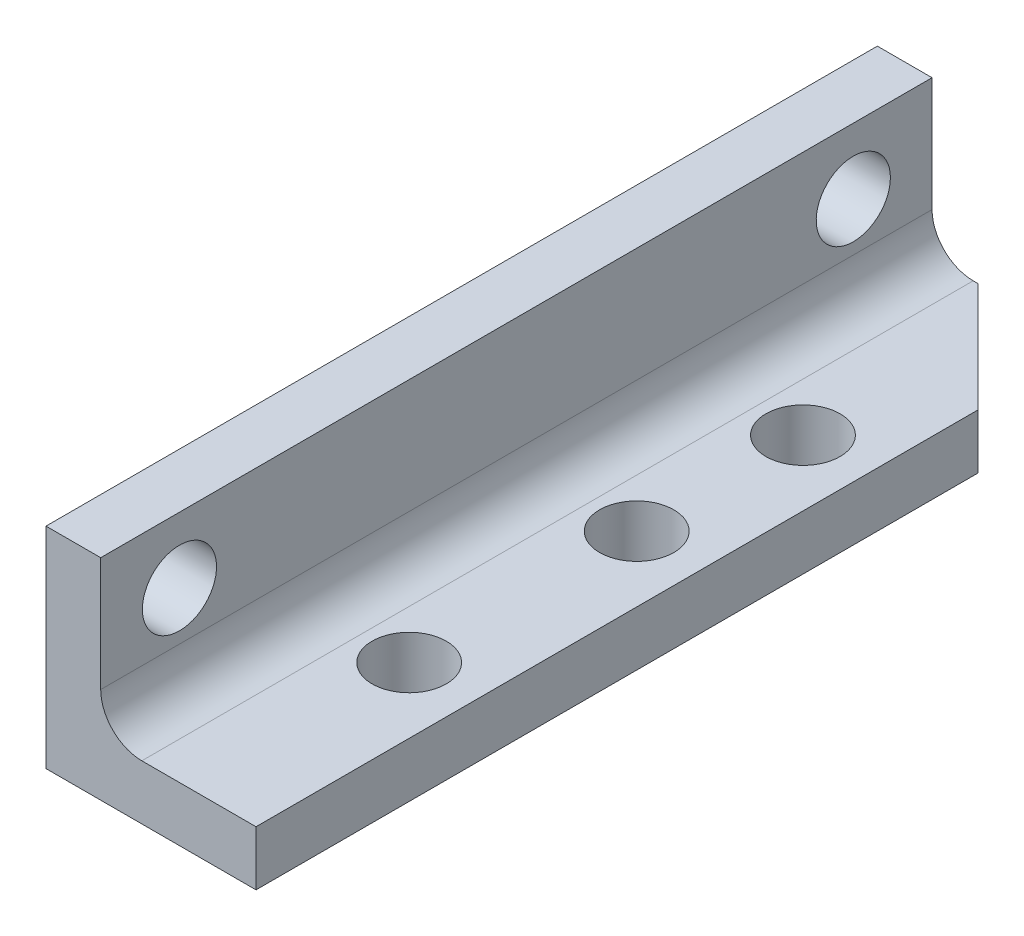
ISO-10303-21;
HEADER;
FILE_DESCRIPTION(('STEP AP214'),'2;1');
FILE_NAME('part.step','',(''),(''),'','','');
FILE_SCHEMA(('AUTOMOTIVE_DESIGN { 1 0 10303 214 1 1 1 1 }'));
ENDSEC;
DATA;
#1=APPLICATION_CONTEXT('core data for automotive mechanical design processes');
#2=APPLICATION_PROTOCOL_DEFINITION('international standard','automotive_design',2000,#1);
#3=PRODUCT_CONTEXT('',#1,'mechanical');
#4=PRODUCT('Part','Part','',(#3));
#5=PRODUCT_RELATED_PRODUCT_CATEGORY('part','',(#4));
#6=PRODUCT_DEFINITION_FORMATION('','',#4);
#7=PRODUCT_DEFINITION_CONTEXT('part definition',#1,'design');
#8=PRODUCT_DEFINITION('design','',#6,#7);
#9=PRODUCT_DEFINITION_SHAPE('','',#8);
#10=(LENGTH_UNIT() NAMED_UNIT(*) SI_UNIT(.MILLI.,.METRE.));
#11=(NAMED_UNIT(*) PLANE_ANGLE_UNIT() SI_UNIT($,.RADIAN.));
#12=(NAMED_UNIT(*) SI_UNIT($,.STERADIAN.) SOLID_ANGLE_UNIT());
#13=UNCERTAINTY_MEASURE_WITH_UNIT(LENGTH_MEASURE(1.E-05),#10,'distance_accuracy_value','');
#14=(GEOMETRIC_REPRESENTATION_CONTEXT(3) GLOBAL_UNCERTAINTY_ASSIGNED_CONTEXT((#13)) GLOBAL_UNIT_ASSIGNED_CONTEXT((#10,
#11,#12)) REPRESENTATION_CONTEXT('',''));
#15=CARTESIAN_POINT('',(0.,0.,0.));
#16=DIRECTION('',(0.,0.,1.));
#17=DIRECTION('',(1.,0.,0.));
#18=AXIS2_PLACEMENT_3D('',#15,#16,#17);
#19=CARTESIAN_POINT('',(0.,0.,24.13));
#20=DIRECTION('',(1.,0.,0.));
#21=DIRECTION('',(0.,0.,-1.));
#22=AXIS2_PLACEMENT_3D('',#19,#20,#21);
#23=PLANE('',#22);
#24=CARTESIAN_POINT('',(0.,8.382,19.558));
#25=DIRECTION('',(-1.,0.,0.));
#26=DIRECTION('',(0.,0.,1.));
#27=AXIS2_PLACEMENT_3D('',#24,#25,#26);
#28=CIRCLE('',#27,2.15264999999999);
#29=CARTESIAN_POINT('',(0.,8.382,21.71065));
#30=VERTEX_POINT('',#29);
#31=EDGE_CURVE('E151',#30,#30,#28,.T.);
#32=ORIENTED_EDGE('',*,*,#31,.F.);
#33=EDGE_LOOP('',(#32));
#34=FACE_BOUND('',#33,.T.);
#35=DIRECTION('',(0.,0.,-1.));
#36=VECTOR('',#35,1.);
#37=CARTESIAN_POINT('',(0.,12.192,24.13));
#38=LINE('',#37,#36);
#39=CARTESIAN_POINT('',(0.,12.192,24.13));
#40=VERTEX_POINT('',#39);
#41=CARTESIAN_POINT('',(0.,12.192,-24.13));
#42=VERTEX_POINT('',#41);
#43=EDGE_CURVE('E124',#40,#42,#38,.T.);
#44=ORIENTED_EDGE('',*,*,#43,.T.);
#45=DIRECTION('',(0.,-1.,0.));
#46=VECTOR('',#45,1.);
#47=CARTESIAN_POINT('',(0.,0.,-24.13));
#48=LINE('',#47,#46);
#49=CARTESIAN_POINT('',(0.,0.,-24.13));
#50=VERTEX_POINT('',#49);
#51=EDGE_CURVE('E119',#42,#50,#48,.T.);
#52=ORIENTED_EDGE('',*,*,#51,.T.);
#53=DIRECTION('',(0.,0.,-1.));
#54=VECTOR('',#53,1.);
#55=CARTESIAN_POINT('',(0.,0.,24.13));
#56=LINE('',#55,#54);
#57=CARTESIAN_POINT('',(0.,0.,24.13));
#58=VERTEX_POINT('',#57);
#59=EDGE_CURVE('E102',#58,#50,#56,.T.);
#60=ORIENTED_EDGE('',*,*,#59,.F.);
#61=DIRECTION('',(0.,-1.,0.));
#62=VECTOR('',#61,1.);
#63=CARTESIAN_POINT('',(0.,0.,24.13));
#64=LINE('',#63,#62);
#65=EDGE_CURVE('E155',#40,#58,#64,.T.);
#66=ORIENTED_EDGE('',*,*,#65,.F.);
#67=EDGE_LOOP('',(#44,#52,#60,#66));
#68=FACE_BOUND('',#67,.T.);
#69=CARTESIAN_POINT('',(0.,8.382,-19.558));
#70=DIRECTION('',(1.,0.,0.));
#71=DIRECTION('',(0.,0.,-1.));
#72=AXIS2_PLACEMENT_3D('',#69,#70,#71);
#73=CIRCLE('',#72,2.15264999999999);
#74=CARTESIAN_POINT('',(0.,8.382,-21.71065));
#75=VERTEX_POINT('',#74);
#76=EDGE_CURVE('E129',#75,#75,#73,.T.);
#77=ORIENTED_EDGE('',*,*,#76,.T.);
#78=EDGE_LOOP('',(#77));
#79=FACE_BOUND('',#78,.T.);
#80=ADVANCED_FACE('F39',(#34,#68,#79),#23,.F.);
#81=CARTESIAN_POINT('',(0.,0.,24.13));
#82=DIRECTION('',(0.,1.,0.));
#83=DIRECTION('',(0.,0.,1.));
#84=AXIS2_PLACEMENT_3D('',#81,#82,#83);
#85=PLANE('',#84);
#86=CARTESIAN_POINT('',(8.382,0.,-1.778));
#87=DIRECTION('',(0.,1.,0.));
#88=DIRECTION('',(0.,0.,1.));
#89=AXIS2_PLACEMENT_3D('',#86,#87,#88);
#90=CIRCLE('',#89,2.15265);
#91=CARTESIAN_POINT('',(8.382,0.,0.374649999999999));
#92=VERTEX_POINT('',#91);
#93=EDGE_CURVE('E381',#92,#92,#90,.T.);
#94=ORIENTED_EDGE('',*,*,#93,.T.);
#95=EDGE_LOOP('',(#94));
#96=FACE_BOUND('',#95,.T.);
#97=CARTESIAN_POINT('',(8.382,0.,11.43));
#98=DIRECTION('',(0.,-1.,0.));
#99=DIRECTION('',(0.,0.,-1.));
#100=AXIS2_PLACEMENT_3D('',#97,#98,#99);
#101=CIRCLE('',#100,2.15264999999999);
#102=CARTESIAN_POINT('',(8.382,0.,9.27735000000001));
#103=VERTEX_POINT('',#102);
#104=EDGE_CURVE('E142',#103,#103,#101,.T.);
#105=ORIENTED_EDGE('',*,*,#104,.F.);
#106=EDGE_LOOP('',(#105));
#107=FACE_BOUND('',#106,.T.);
#108=DIRECTION('',(1.,0.,0.));
#109=VECTOR('',#108,1.);
#110=CARTESIAN_POINT('',(0.,0.,-24.13));
#111=LINE('',#110,#109);
#112=CARTESIAN_POINT('',(5.84199999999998,0.,-24.13));
#113=VERTEX_POINT('',#112);
#114=EDGE_CURVE('E105',#50,#113,#111,.T.);
#115=ORIENTED_EDGE('',*,*,#114,.T.);
#116=DIRECTION('',(0.707106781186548,0.,0.707106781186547));
#117=VECTOR('',#116,1.);
#118=CARTESIAN_POINT('',(12.192,0.,-17.78));
#119=LINE('',#118,#117);
#120=CARTESIAN_POINT('',(12.192,0.,-17.78));
#121=VERTEX_POINT('',#120);
#122=EDGE_CURVE('E11',#113,#121,#119,.T.);
#123=ORIENTED_EDGE('',*,*,#122,.T.);
#124=DIRECTION('',(0.,0.,-1.));
#125=VECTOR('',#124,1.);
#126=CARTESIAN_POINT('',(12.192,0.,24.13));
#127=LINE('',#126,#125);
#128=CARTESIAN_POINT('',(12.192,0.,24.13));
#129=VERTEX_POINT('',#128);
#130=EDGE_CURVE('E114',#129,#121,#127,.T.);
#131=ORIENTED_EDGE('',*,*,#130,.F.);
#132=DIRECTION('',(1.,0.,0.));
#133=VECTOR('',#132,1.);
#134=CARTESIAN_POINT('',(0.,0.,24.13));
#135=LINE('',#134,#133);
#136=EDGE_CURVE('E108',#58,#129,#135,.T.);
#137=ORIENTED_EDGE('',*,*,#136,.F.);
#138=ORIENTED_EDGE('',*,*,#59,.T.);
#139=EDGE_LOOP('',(#115,#123,#131,#137,#138));
#140=FACE_BOUND('',#139,.T.);
#141=CARTESIAN_POINT('',(8.382,0.,-11.43));
#142=DIRECTION('',(0.,1.,0.));
#143=DIRECTION('',(0.,0.,1.));
#144=AXIS2_PLACEMENT_3D('',#141,#142,#143);
#145=CIRCLE('',#144,2.15264999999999);
#146=CARTESIAN_POINT('',(8.382,0.,-9.27735000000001));
#147=VERTEX_POINT('',#146);
#148=EDGE_CURVE('E147',#147,#147,#145,.T.);
#149=ORIENTED_EDGE('',*,*,#148,.T.);
#150=EDGE_LOOP('',(#149));
#151=FACE_BOUND('',#150,.T.);
#152=ADVANCED_FACE('F103',(#96,#107,#140,#151),#85,.F.);
#153=CARTESIAN_POINT('',(12.192,0.,24.13));
#154=DIRECTION('',(-1.,0.,0.));
#155=DIRECTION('',(0.,-1.,0.));
#156=AXIS2_PLACEMENT_3D('',#153,#154,#155);
#157=PLANE('',#156);
#158=ORIENTED_EDGE('',*,*,#130,.T.);
#159=DIRECTION('',(0.,1.,0.));
#160=VECTOR('',#159,1.);
#161=CARTESIAN_POINT('',(12.192,3.175,-17.78));
#162=LINE('',#161,#160);
#163=CARTESIAN_POINT('',(12.192,3.175,-17.78));
#164=VERTEX_POINT('',#163);
#165=EDGE_CURVE('E113',#121,#164,#162,.T.);
#166=ORIENTED_EDGE('',*,*,#165,.T.);
#167=DIRECTION('',(0.,0.,-1.));
#168=VECTOR('',#167,1.);
#169=CARTESIAN_POINT('',(12.192,3.175,24.13));
#170=LINE('',#169,#168);
#171=CARTESIAN_POINT('',(12.192,3.175,24.13));
#172=VERTEX_POINT('',#171);
#173=EDGE_CURVE('E176',#172,#164,#170,.T.);
#174=ORIENTED_EDGE('',*,*,#173,.F.);
#175=DIRECTION('',(0.,1.,0.));
#176=VECTOR('',#175,1.);
#177=CARTESIAN_POINT('',(12.192,0.,24.13));
#178=LINE('',#177,#176);
#179=EDGE_CURVE('E158',#129,#172,#178,.T.);
#180=ORIENTED_EDGE('',*,*,#179,.F.);
#181=EDGE_LOOP('',(#158,#166,#174,#180));
#182=FACE_BOUND('',#181,.T.);
#183=ADVANCED_FACE('F189',(#182),#157,.F.);
#184=CARTESIAN_POINT('',(5.5626,3.175,24.13));
#185=DIRECTION('',(0.,-1.,0.));
#186=DIRECTION('',(0.,0.,-1.));
#187=AXIS2_PLACEMENT_3D('',#184,#185,#186);
#188=PLANE('',#187);
#189=CARTESIAN_POINT('',(8.382,3.175,-1.778));
#190=DIRECTION('',(0.,1.,0.));
#191=DIRECTION('',(0.,0.,1.));
#192=AXIS2_PLACEMENT_3D('',#189,#190,#191);
#193=CIRCLE('',#192,2.15264999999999);
#194=CARTESIAN_POINT('',(8.382,3.175,0.374649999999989));
#195=VERTEX_POINT('',#194);
#196=EDGE_CURVE('E379',#195,#195,#193,.T.);
#197=ORIENTED_EDGE('',*,*,#196,.F.);
#198=EDGE_LOOP('',(#197));
#199=FACE_BOUND('',#198,.T.);
#200=CARTESIAN_POINT('',(8.382,3.175,11.43));
#201=DIRECTION('',(0.,-1.,0.));
#202=DIRECTION('',(0.,0.,-1.));
#203=AXIS2_PLACEMENT_3D('',#200,#201,#202);
#204=CIRCLE('',#203,2.15264999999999);
#205=CARTESIAN_POINT('',(8.382,3.175,9.27735000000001));
#206=VERTEX_POINT('',#205);
#207=EDGE_CURVE('E150',#206,#206,#204,.T.);
#208=ORIENTED_EDGE('',*,*,#207,.T.);
#209=EDGE_LOOP('',(#208));
#210=FACE_BOUND('',#209,.T.);
#211=ORIENTED_EDGE('',*,*,#173,.T.);
#212=DIRECTION('',(-0.707106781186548,0.,-0.707106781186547));
#213=VECTOR('',#212,1.);
#214=CARTESIAN_POINT('',(12.192,3.175,-17.78));
#215=LINE('',#214,#213);
#216=CARTESIAN_POINT('',(5.84199999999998,3.175,-24.13));
#217=VERTEX_POINT('',#216);
#218=EDGE_CURVE('E61',#164,#217,#215,.T.);
#219=ORIENTED_EDGE('',*,*,#218,.T.);
#220=DIRECTION('',(-1.,0.,0.));
#221=VECTOR('',#220,1.);
#222=CARTESIAN_POINT('',(5.5626,3.175,-24.13));
#223=LINE('',#222,#221);
#224=CARTESIAN_POINT('',(5.5626,3.175,-24.13));
#225=VERTEX_POINT('',#224);
#226=EDGE_CURVE('E120',#217,#225,#223,.T.);
#227=ORIENTED_EDGE('',*,*,#226,.T.);
#228=DIRECTION('',(0.,0.,-1.));
#229=VECTOR('',#228,1.);
#230=CARTESIAN_POINT('',(5.5626,3.175,24.13));
#231=LINE('',#230,#229);
#232=CARTESIAN_POINT('',(5.5626,3.175,24.13));
#233=VERTEX_POINT('',#232);
#234=EDGE_CURVE('E173',#233,#225,#231,.T.);
#235=ORIENTED_EDGE('',*,*,#234,.F.);
#236=DIRECTION('',(-1.,0.,0.));
#237=VECTOR('',#236,1.);
#238=CARTESIAN_POINT('',(5.5626,3.175,24.13));
#239=LINE('',#238,#237);
#240=EDGE_CURVE('E160',#172,#233,#239,.T.);
#241=ORIENTED_EDGE('',*,*,#240,.F.);
#242=EDGE_LOOP('',(#211,#219,#227,#235,#241));
#243=FACE_BOUND('',#242,.T.);
#244=CARTESIAN_POINT('',(8.382,3.175,-11.43));
#245=DIRECTION('',(0.,1.,0.));
#246=DIRECTION('',(0.,0.,1.));
#247=AXIS2_PLACEMENT_3D('',#244,#245,#246);
#248=CIRCLE('',#247,2.15264999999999);
#249=CARTESIAN_POINT('',(8.382,3.175,-9.27735000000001));
#250=VERTEX_POINT('',#249);
#251=EDGE_CURVE('E144',#250,#250,#248,.T.);
#252=ORIENTED_EDGE('',*,*,#251,.F.);
#253=EDGE_LOOP('',(#252));
#254=FACE_BOUND('',#253,.T.);
#255=ADVANCED_FACE('F193',(#199,#210,#243,#254),#188,.F.);
#256=CARTESIAN_POINT('',(5.5626,5.5626,24.13));
#257=DIRECTION('',(0.,0.,-1.));
#258=DIRECTION('',(-1.,0.,0.));
#259=AXIS2_PLACEMENT_3D('',#256,#257,#258);
#260=CYLINDRICAL_SURFACE('',#259,2.3876);
#261=ORIENTED_EDGE('',*,*,#234,.T.);
#262=CARTESIAN_POINT('',(5.5626,5.5626,-24.13));
#263=DIRECTION('',(0.,0.,-1.));
#264=DIRECTION('',(1.,0.,0.));
#265=AXIS2_PLACEMENT_3D('',#262,#263,#264);
#266=CIRCLE('',#265,2.3876);
#267=CARTESIAN_POINT('',(3.175,5.5626,-24.13));
#268=VERTEX_POINT('',#267);
#269=EDGE_CURVE('E135',#225,#268,#266,.T.);
#270=ORIENTED_EDGE('',*,*,#269,.T.);
#271=DIRECTION('',(0.,0.,-1.));
#272=VECTOR('',#271,1.);
#273=CARTESIAN_POINT('',(3.175,5.5626,24.13));
#274=LINE('',#273,#272);
#275=CARTESIAN_POINT('',(3.175,5.5626,24.13));
#276=VERTEX_POINT('',#275);
#277=EDGE_CURVE('E171',#276,#268,#274,.T.);
#278=ORIENTED_EDGE('',*,*,#277,.F.);
#279=CARTESIAN_POINT('',(5.5626,5.5626,24.13));
#280=DIRECTION('',(0.,0.,-1.));
#281=DIRECTION('',(1.,0.,0.));
#282=AXIS2_PLACEMENT_3D('',#279,#280,#281);
#283=CIRCLE('',#282,2.3876);
#284=EDGE_CURVE('E162',#233,#276,#283,.T.);
#285=ORIENTED_EDGE('',*,*,#284,.F.);
#286=EDGE_LOOP('',(#261,#270,#278,#285));
#287=FACE_BOUND('',#286,.T.);
#288=ADVANCED_FACE('F225',(#287),#260,.F.);
#289=CARTESIAN_POINT('',(3.175,12.192,24.13));
#290=DIRECTION('',(-1.,0.,0.));
#291=DIRECTION('',(0.,-1.,0.));
#292=AXIS2_PLACEMENT_3D('',#289,#290,#291);
#293=PLANE('',#292);
#294=CARTESIAN_POINT('',(3.175,8.382,19.558));
#295=DIRECTION('',(-1.,0.,0.));
#296=DIRECTION('',(0.,-1.,0.));
#297=AXIS2_PLACEMENT_3D('',#294,#295,#296);
#298=CIRCLE('',#297,2.15264999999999);
#299=CARTESIAN_POINT('',(3.175,6.22935000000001,19.558));
#300=VERTEX_POINT('',#299);
#301=EDGE_CURVE('E154',#300,#300,#298,.T.);
#302=ORIENTED_EDGE('',*,*,#301,.T.);
#303=EDGE_LOOP('',(#302));
#304=FACE_BOUND('',#303,.T.);
#305=ORIENTED_EDGE('',*,*,#277,.T.);
#306=DIRECTION('',(0.,1.,0.));
#307=VECTOR('',#306,1.);
#308=CARTESIAN_POINT('',(3.175,12.192,-24.13));
#309=LINE('',#308,#307);
#310=CARTESIAN_POINT('',(3.175,12.192,-24.13));
#311=VERTEX_POINT('',#310);
#312=EDGE_CURVE('E138',#268,#311,#309,.T.);
#313=ORIENTED_EDGE('',*,*,#312,.T.);
#314=DIRECTION('',(0.,0.,-1.));
#315=VECTOR('',#314,1.);
#316=CARTESIAN_POINT('',(3.175,12.192,24.13));
#317=LINE('',#316,#315);
#318=CARTESIAN_POINT('',(3.175,12.192,24.13));
#319=VERTEX_POINT('',#318);
#320=EDGE_CURVE('E169',#319,#311,#317,.T.);
#321=ORIENTED_EDGE('',*,*,#320,.F.);
#322=DIRECTION('',(0.,1.,0.));
#323=VECTOR('',#322,1.);
#324=CARTESIAN_POINT('',(3.175,12.192,24.13));
#325=LINE('',#324,#323);
#326=EDGE_CURVE('E164',#276,#319,#325,.T.);
#327=ORIENTED_EDGE('',*,*,#326,.F.);
#328=EDGE_LOOP('',(#305,#313,#321,#327));
#329=FACE_BOUND('',#328,.T.);
#330=CARTESIAN_POINT('',(3.175,8.382,-19.558));
#331=DIRECTION('',(1.,0.,0.));
#332=DIRECTION('',(0.,-1.,0.));
#333=AXIS2_PLACEMENT_3D('',#330,#331,#332);
#334=CIRCLE('',#333,2.15264999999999);
#335=CARTESIAN_POINT('',(3.175,6.22935000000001,-19.558));
#336=VERTEX_POINT('',#335);
#337=EDGE_CURVE('E126',#336,#336,#334,.T.);
#338=ORIENTED_EDGE('',*,*,#337,.F.);
#339=EDGE_LOOP('',(#338));
#340=FACE_BOUND('',#339,.T.);
#341=ADVANCED_FACE('F229',(#304,#329,#340),#293,.F.);
#342=CARTESIAN_POINT('',(0.,12.192,24.13));
#343=DIRECTION('',(0.,-1.,0.));
#344=DIRECTION('',(1.,0.,0.));
#345=AXIS2_PLACEMENT_3D('',#342,#343,#344);
#346=PLANE('',#345);
#347=ORIENTED_EDGE('',*,*,#320,.T.);
#348=DIRECTION('',(-1.,0.,0.));
#349=VECTOR('',#348,1.);
#350=CARTESIAN_POINT('',(0.,12.192,-24.13));
#351=LINE('',#350,#349);
#352=EDGE_CURVE('E141',#311,#42,#351,.T.);
#353=ORIENTED_EDGE('',*,*,#352,.T.);
#354=ORIENTED_EDGE('',*,*,#43,.F.);
#355=DIRECTION('',(-1.,0.,0.));
#356=VECTOR('',#355,1.);
#357=CARTESIAN_POINT('',(0.,12.192,24.13));
#358=LINE('',#357,#356);
#359=EDGE_CURVE('E166',#319,#40,#358,.T.);
#360=ORIENTED_EDGE('',*,*,#359,.F.);
#361=EDGE_LOOP('',(#347,#353,#354,#360));
#362=FACE_BOUND('',#361,.T.);
#363=ADVANCED_FACE('F233',(#362),#346,.F.);
#364=CARTESIAN_POINT('',(5.5626,5.5626,24.13));
#365=DIRECTION('',(0.,0.,1.));
#366=DIRECTION('',(1.,0.,0.));
#367=AXIS2_PLACEMENT_3D('',#364,#365,#366);
#368=PLANE('',#367);
#369=ORIENTED_EDGE('',*,*,#65,.T.);
#370=ORIENTED_EDGE('',*,*,#136,.T.);
#371=ORIENTED_EDGE('',*,*,#179,.T.);
#372=ORIENTED_EDGE('',*,*,#240,.T.);
#373=ORIENTED_EDGE('',*,*,#284,.T.);
#374=ORIENTED_EDGE('',*,*,#326,.T.);
#375=ORIENTED_EDGE('',*,*,#359,.T.);
#376=EDGE_LOOP('',(#369,#370,#371,#372,#373,#374,#375));
#377=FACE_BOUND('',#376,.T.);
#378=ADVANCED_FACE('F198',(#377),#368,.T.);
#379=CARTESIAN_POINT('',(0.,8.382,19.558));
#380=DIRECTION('',(-1.,0.,0.));
#381=DIRECTION('',(0.,0.,1.));
#382=AXIS2_PLACEMENT_3D('',#379,#380,#381);
#383=CYLINDRICAL_SURFACE('',#382,2.15264999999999);
#384=ORIENTED_EDGE('',*,*,#31,.T.);
#385=EDGE_LOOP('',(#384));
#386=FACE_BOUND('',#385,.T.);
#387=ORIENTED_EDGE('',*,*,#301,.F.);
#388=EDGE_LOOP('',(#387));
#389=FACE_BOUND('',#388,.T.);
#390=ADVANCED_FACE('F240',(#386,#389),#383,.F.);
#391=CARTESIAN_POINT('',(8.382,0.,11.43));
#392=DIRECTION('',(0.,-1.,0.));
#393=DIRECTION('',(0.,0.,-1.));
#394=AXIS2_PLACEMENT_3D('',#391,#392,#393);
#395=CYLINDRICAL_SURFACE('',#394,2.15264999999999);
#396=ORIENTED_EDGE('',*,*,#104,.T.);
#397=EDGE_LOOP('',(#396));
#398=FACE_BOUND('',#397,.T.);
#399=ORIENTED_EDGE('',*,*,#207,.F.);
#400=EDGE_LOOP('',(#399));
#401=FACE_BOUND('',#400,.T.);
#402=ADVANCED_FACE('F243',(#398,#401),#395,.F.);
#403=CARTESIAN_POINT('',(5.5626,5.5626,-24.13));
#404=DIRECTION('',(0.,0.,-1.));
#405=DIRECTION('',(1.,0.,0.));
#406=AXIS2_PLACEMENT_3D('',#403,#404,#405);
#407=PLANE('',#406);
#408=ORIENTED_EDGE('',*,*,#226,.F.);
#409=DIRECTION('',(0.,-1.,0.));
#410=VECTOR('',#409,1.);
#411=CARTESIAN_POINT('',(5.84199999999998,0.,-24.13));
#412=LINE('',#411,#410);
#413=EDGE_CURVE('E47',#217,#113,#412,.T.);
#414=ORIENTED_EDGE('',*,*,#413,.T.);
#415=ORIENTED_EDGE('',*,*,#114,.F.);
#416=ORIENTED_EDGE('',*,*,#51,.F.);
#417=ORIENTED_EDGE('',*,*,#352,.F.);
#418=ORIENTED_EDGE('',*,*,#312,.F.);
#419=ORIENTED_EDGE('',*,*,#269,.F.);
#420=EDGE_LOOP('',(#408,#414,#415,#416,#417,#418,#419));
#421=FACE_BOUND('',#420,.T.);
#422=ADVANCED_FACE('F117',(#421),#407,.T.);
#423=CARTESIAN_POINT('',(0.,8.382,-19.558));
#424=DIRECTION('',(-1.,0.,0.));
#425=DIRECTION('',(0.,0.,-1.));
#426=AXIS2_PLACEMENT_3D('',#423,#424,#425);
#427=CYLINDRICAL_SURFACE('',#426,2.15264999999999);
#428=ORIENTED_EDGE('',*,*,#76,.F.);
#429=EDGE_LOOP('',(#428));
#430=FACE_BOUND('',#429,.T.);
#431=ORIENTED_EDGE('',*,*,#337,.T.);
#432=EDGE_LOOP('',(#431));
#433=FACE_BOUND('',#432,.T.);
#434=ADVANCED_FACE('F209',(#430,#433),#427,.F.);
#435=CARTESIAN_POINT('',(8.382,0.,-11.43));
#436=DIRECTION('',(0.,-1.,0.));
#437=DIRECTION('',(0.,0.,1.));
#438=AXIS2_PLACEMENT_3D('',#435,#436,#437);
#439=CYLINDRICAL_SURFACE('',#438,2.15264999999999);
#440=ORIENTED_EDGE('',*,*,#148,.F.);
#441=EDGE_LOOP('',(#440));
#442=FACE_BOUND('',#441,.T.);
#443=ORIENTED_EDGE('',*,*,#251,.T.);
#444=EDGE_LOOP('',(#443));
#445=FACE_BOUND('',#444,.T.);
#446=ADVANCED_FACE('F202',(#442,#445),#439,.F.);
#447=CARTESIAN_POINT('',(12.192,0.,-17.78));
#448=DIRECTION('',(0.707106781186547,0.,-0.707106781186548));
#449=DIRECTION('',(-0.707106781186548,0.,-0.707106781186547));
#450=AXIS2_PLACEMENT_3D('',#447,#448,#449);
#451=PLANE('',#450);
#452=ORIENTED_EDGE('',*,*,#122,.F.);
#453=ORIENTED_EDGE('',*,*,#413,.F.);
#454=ORIENTED_EDGE('',*,*,#218,.F.);
#455=ORIENTED_EDGE('',*,*,#165,.F.);
#456=EDGE_LOOP('',(#452,#453,#454,#455));
#457=FACE_BOUND('',#456,.T.);
#458=ADVANCED_FACE('F41',(#457),#451,.T.);
#459=CARTESIAN_POINT('',(8.382,3.175,-1.778));
#460=DIRECTION('',(0.,1.,0.));
#461=DIRECTION('',(0.,0.,1.));
#462=AXIS2_PLACEMENT_3D('',#459,#460,#461);
#463=CYLINDRICAL_SURFACE('',#462,2.15264999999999);
#464=ORIENTED_EDGE('',*,*,#93,.F.);
#465=EDGE_LOOP('',(#464));
#466=FACE_BOUND('',#465,.T.);
#467=ORIENTED_EDGE('',*,*,#196,.T.);
#468=EDGE_LOOP('',(#467));
#469=FACE_BOUND('',#468,.T.);
#470=ADVANCED_FACE('F201',(#466,#469),#463,.F.);
#471=CLOSED_SHELL('',(#80,#152,#183,#255,#288,#341,#363,#378,#390,#402,#422,#434,#446,#458,#470));
#472=MANIFOLD_SOLID_BREP('B2',#471);
#473=ADVANCED_BREP_SHAPE_REPRESENTATION('',(#18,#472),#14);
#474=SHAPE_DEFINITION_REPRESENTATION(#9,#473);
ENDSEC;
END-ISO-10303-21;
